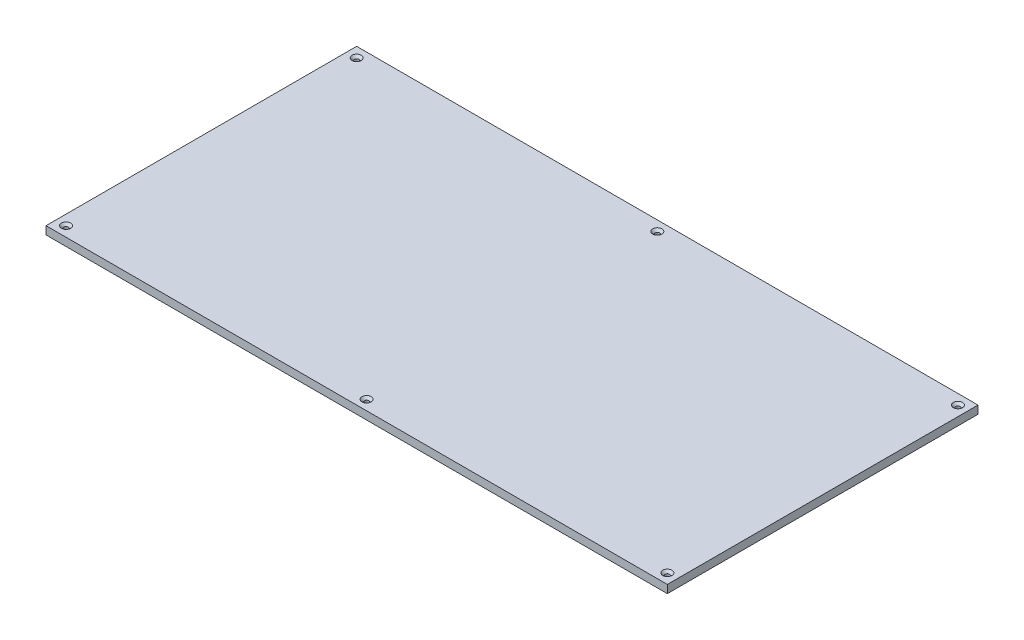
ISO-10303-21;
HEADER;
FILE_DESCRIPTION(('STEP AP214'),'2;1');
FILE_NAME('part.step','',(''),(''),'','','');
FILE_SCHEMA(('AUTOMOTIVE_DESIGN { 1 0 10303 214 1 1 1 1 }'));
ENDSEC;
DATA;
#1=APPLICATION_CONTEXT('core data for automotive mechanical design processes');
#2=APPLICATION_PROTOCOL_DEFINITION('international standard','automotive_design',2000,#1);
#3=PRODUCT_CONTEXT('',#1,'mechanical');
#4=PRODUCT('Part','Part','',(#3));
#5=PRODUCT_RELATED_PRODUCT_CATEGORY('part','',(#4));
#6=PRODUCT_DEFINITION_FORMATION('','',#4);
#7=PRODUCT_DEFINITION_CONTEXT('part definition',#1,'design');
#8=PRODUCT_DEFINITION('design','',#6,#7);
#9=PRODUCT_DEFINITION_SHAPE('','',#8);
#10=(LENGTH_UNIT() NAMED_UNIT(*) SI_UNIT(.MILLI.,.METRE.));
#11=(NAMED_UNIT(*) PLANE_ANGLE_UNIT() SI_UNIT($,.RADIAN.));
#12=(NAMED_UNIT(*) SI_UNIT($,.STERADIAN.) SOLID_ANGLE_UNIT());
#13=UNCERTAINTY_MEASURE_WITH_UNIT(LENGTH_MEASURE(1.E-05),#10,'distance_accuracy_value','');
#14=(GEOMETRIC_REPRESENTATION_CONTEXT(3) GLOBAL_UNCERTAINTY_ASSIGNED_CONTEXT((#13)) GLOBAL_UNIT_ASSIGNED_CONTEXT((#10,
#11,#12)) REPRESENTATION_CONTEXT('',''));
#15=CARTESIAN_POINT('',(0.,0.,0.));
#16=DIRECTION('',(0.,0.,1.));
#17=DIRECTION('',(1.,0.,0.));
#18=AXIS2_PLACEMENT_3D('',#15,#16,#17);
#19=CARTESIAN_POINT('',(310.,8.,155.));
#20=DIRECTION('',(-1.,0.,0.));
#21=DIRECTION('',(0.,0.,1.));
#22=AXIS2_PLACEMENT_3D('',#19,#20,#21);
#23=PLANE('',#22);
#24=DIRECTION('',(0.,0.,-1.));
#25=VECTOR('',#24,1.);
#26=CARTESIAN_POINT('',(310.,0.,155.));
#27=LINE('',#26,#25);
#28=CARTESIAN_POINT('',(310.,0.,155.));
#29=VERTEX_POINT('',#28);
#30=CARTESIAN_POINT('',(310.,0.,-155.));
#31=VERTEX_POINT('',#30);
#32=EDGE_CURVE('E113',#29,#31,#27,.T.);
#33=ORIENTED_EDGE('',*,*,#32,.T.);
#34=DIRECTION('',(0.,-1.,0.));
#35=VECTOR('',#34,1.);
#36=CARTESIAN_POINT('',(310.,8.,-155.));
#37=LINE('',#36,#35);
#38=CARTESIAN_POINT('',(310.,8.,-155.));
#39=VERTEX_POINT('',#38);
#40=EDGE_CURVE('E11',#39,#31,#37,.T.);
#41=ORIENTED_EDGE('',*,*,#40,.F.);
#42=DIRECTION('',(0.,0.,-1.));
#43=VECTOR('',#42,1.);
#44=CARTESIAN_POINT('',(310.,8.,155.));
#45=LINE('',#44,#43);
#46=CARTESIAN_POINT('',(310.,8.,155.));
#47=VERTEX_POINT('',#46);
#48=EDGE_CURVE('E95',#47,#39,#45,.T.);
#49=ORIENTED_EDGE('',*,*,#48,.F.);
#50=DIRECTION('',(0.,-1.,0.));
#51=VECTOR('',#50,1.);
#52=CARTESIAN_POINT('',(310.,8.,155.));
#53=LINE('',#52,#51);
#54=EDGE_CURVE('E109',#47,#29,#53,.T.);
#55=ORIENTED_EDGE('',*,*,#54,.T.);
#56=EDGE_LOOP('',(#33,#41,#49,#55));
#57=FACE_BOUND('',#56,.T.);
#58=ADVANCED_FACE('F43',(#57),#23,.F.);
#59=CARTESIAN_POINT('',(-310.,8.,-155.));
#60=DIRECTION('',(0.,0.,1.));
#61=DIRECTION('',(1.,0.,0.));
#62=AXIS2_PLACEMENT_3D('',#59,#60,#61);
#63=PLANE('',#62);
#64=DIRECTION('',(-1.,0.,0.));
#65=VECTOR('',#64,1.);
#66=CARTESIAN_POINT('',(-310.,0.,-155.));
#67=LINE('',#66,#65);
#68=CARTESIAN_POINT('',(-310.,0.,-155.));
#69=VERTEX_POINT('',#68);
#70=EDGE_CURVE('E100',#31,#69,#67,.T.);
#71=ORIENTED_EDGE('',*,*,#70,.T.);
#72=DIRECTION('',(0.,-1.,0.));
#73=VECTOR('',#72,1.);
#74=CARTESIAN_POINT('',(-310.,8.,-155.));
#75=LINE('',#74,#73);
#76=CARTESIAN_POINT('',(-310.,8.,-155.));
#77=VERTEX_POINT('',#76);
#78=EDGE_CURVE('E52',#77,#69,#75,.T.);
#79=ORIENTED_EDGE('',*,*,#78,.F.);
#80=DIRECTION('',(-1.,0.,0.));
#81=VECTOR('',#80,1.);
#82=CARTESIAN_POINT('',(-310.,8.,-155.));
#83=LINE('',#82,#81);
#84=EDGE_CURVE('E90',#39,#77,#83,.T.);
#85=ORIENTED_EDGE('',*,*,#84,.F.);
#86=ORIENTED_EDGE('',*,*,#40,.T.);
#87=EDGE_LOOP('',(#71,#79,#85,#86));
#88=FACE_BOUND('',#87,.T.);
#89=ADVANCED_FACE('F99',(#88),#63,.F.);
#90=CARTESIAN_POINT('',(-310.,8.,155.));
#91=DIRECTION('',(1.,0.,0.));
#92=DIRECTION('',(0.,0.,-1.));
#93=AXIS2_PLACEMENT_3D('',#90,#91,#92);
#94=PLANE('',#93);
#95=DIRECTION('',(0.,0.,1.));
#96=VECTOR('',#95,1.);
#97=CARTESIAN_POINT('',(-310.,0.,155.));
#98=LINE('',#97,#96);
#99=CARTESIAN_POINT('',(-310.,0.,155.));
#100=VERTEX_POINT('',#99);
#101=EDGE_CURVE('E77',#69,#100,#98,.T.);
#102=ORIENTED_EDGE('',*,*,#101,.T.);
#103=DIRECTION('',(0.,-1.,0.));
#104=VECTOR('',#103,1.);
#105=CARTESIAN_POINT('',(-310.,8.,155.));
#106=LINE('',#105,#104);
#107=CARTESIAN_POINT('',(-310.,8.,155.));
#108=VERTEX_POINT('',#107);
#109=EDGE_CURVE('E102',#108,#100,#106,.T.);
#110=ORIENTED_EDGE('',*,*,#109,.F.);
#111=DIRECTION('',(0.,0.,1.));
#112=VECTOR('',#111,1.);
#113=CARTESIAN_POINT('',(-310.,8.,155.));
#114=LINE('',#113,#112);
#115=EDGE_CURVE('E93',#77,#108,#114,.T.);
#116=ORIENTED_EDGE('',*,*,#115,.F.);
#117=ORIENTED_EDGE('',*,*,#78,.T.);
#118=EDGE_LOOP('',(#102,#110,#116,#117));
#119=FACE_BOUND('',#118,.T.);
#120=ADVANCED_FACE('F103',(#119),#94,.F.);
#121=CARTESIAN_POINT('',(-310.,8.,155.));
#122=DIRECTION('',(0.,0.,-1.));
#123=DIRECTION('',(-1.,0.,0.));
#124=AXIS2_PLACEMENT_3D('',#121,#122,#123);
#125=PLANE('',#124);
#126=DIRECTION('',(1.,0.,0.));
#127=VECTOR('',#126,1.);
#128=CARTESIAN_POINT('',(-310.,0.,155.));
#129=LINE('',#128,#127);
#130=EDGE_CURVE('E83',#100,#29,#129,.T.);
#131=ORIENTED_EDGE('',*,*,#130,.T.);
#132=ORIENTED_EDGE('',*,*,#54,.F.);
#133=DIRECTION('',(1.,0.,0.));
#134=VECTOR('',#133,1.);
#135=CARTESIAN_POINT('',(-310.,8.,155.));
#136=LINE('',#135,#134);
#137=EDGE_CURVE('E60',#108,#47,#136,.T.);
#138=ORIENTED_EDGE('',*,*,#137,.F.);
#139=ORIENTED_EDGE('',*,*,#109,.T.);
#140=EDGE_LOOP('',(#131,#132,#138,#139));
#141=FACE_BOUND('',#140,.T.);
#142=ADVANCED_FACE('F128',(#141),#125,.F.);
#143=CARTESIAN_POINT('',(0.,8.,0.));
#144=DIRECTION('',(0.,-1.,0.));
#145=DIRECTION('',(0.,0.,-1.));
#146=AXIS2_PLACEMENT_3D('',#143,#144,#145);
#147=PLANE('',#146);
#148=CARTESIAN_POINT('',(-300.,8.,145.));
#149=DIRECTION('',(0.,1.,0.));
#150=DIRECTION('',(0.,0.,1.));
#151=AXIS2_PLACEMENT_3D('',#148,#149,#150);
#152=CIRCLE('',#151,4.59999999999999);
#153=CARTESIAN_POINT('',(-300.,8.,149.6));
#154=VERTEX_POINT('',#153);
#155=EDGE_CURVE('E203',#154,#154,#152,.T.);
#156=ORIENTED_EDGE('',*,*,#155,.F.);
#157=EDGE_LOOP('',(#156));
#158=FACE_BOUND('',#157,.T.);
#159=CARTESIAN_POINT('',(0.,8.,145.));
#160=DIRECTION('',(0.,1.,0.));
#161=DIRECTION('',(0.,0.,1.));
#162=AXIS2_PLACEMENT_3D('',#159,#160,#161);
#163=CIRCLE('',#162,4.6);
#164=CARTESIAN_POINT('',(0.,8.,149.6));
#165=VERTEX_POINT('',#164);
#166=EDGE_CURVE('E191',#165,#165,#163,.T.);
#167=ORIENTED_EDGE('',*,*,#166,.F.);
#168=EDGE_LOOP('',(#167));
#169=FACE_BOUND('',#168,.T.);
#170=CARTESIAN_POINT('',(300.,8.,145.));
#171=DIRECTION('',(0.,1.,0.));
#172=DIRECTION('',(0.,0.,1.));
#173=AXIS2_PLACEMENT_3D('',#170,#171,#172);
#174=CIRCLE('',#173,4.59999999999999);
#175=CARTESIAN_POINT('',(300.,8.,149.6));
#176=VERTEX_POINT('',#175);
#177=EDGE_CURVE('E179',#176,#176,#174,.T.);
#178=ORIENTED_EDGE('',*,*,#177,.F.);
#179=EDGE_LOOP('',(#178));
#180=FACE_BOUND('',#179,.T.);
#181=CARTESIAN_POINT('',(300.,8.,-145.));
#182=DIRECTION('',(0.,1.,0.));
#183=DIRECTION('',(0.,0.,1.));
#184=AXIS2_PLACEMENT_3D('',#181,#182,#183);
#185=CIRCLE('',#184,4.59999999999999);
#186=CARTESIAN_POINT('',(300.,8.,-140.4));
#187=VERTEX_POINT('',#186);
#188=EDGE_CURVE('E167',#187,#187,#185,.T.);
#189=ORIENTED_EDGE('',*,*,#188,.F.);
#190=EDGE_LOOP('',(#189));
#191=FACE_BOUND('',#190,.T.);
#192=CARTESIAN_POINT('',(0.,8.,-145.));
#193=DIRECTION('',(0.,1.,0.));
#194=DIRECTION('',(0.,0.,1.));
#195=AXIS2_PLACEMENT_3D('',#192,#193,#194);
#196=CIRCLE('',#195,4.6);
#197=CARTESIAN_POINT('',(0.,8.,-140.4));
#198=VERTEX_POINT('',#197);
#199=EDGE_CURVE('E155',#198,#198,#196,.T.);
#200=ORIENTED_EDGE('',*,*,#199,.F.);
#201=EDGE_LOOP('',(#200));
#202=FACE_BOUND('',#201,.T.);
#203=CARTESIAN_POINT('',(-300.,8.,-145.));
#204=DIRECTION('',(0.,1.,0.));
#205=DIRECTION('',(0.,0.,1.));
#206=AXIS2_PLACEMENT_3D('',#203,#204,#205);
#207=CIRCLE('',#206,4.59999999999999);
#208=CARTESIAN_POINT('',(-300.,8.,-140.4));
#209=VERTEX_POINT('',#208);
#210=EDGE_CURVE('E143',#209,#209,#207,.T.);
#211=ORIENTED_EDGE('',*,*,#210,.F.);
#212=EDGE_LOOP('',(#211));
#213=FACE_BOUND('',#212,.T.);
#214=ORIENTED_EDGE('',*,*,#48,.T.);
#215=ORIENTED_EDGE('',*,*,#84,.T.);
#216=ORIENTED_EDGE('',*,*,#115,.T.);
#217=ORIENTED_EDGE('',*,*,#137,.T.);
#218=EDGE_LOOP('',(#214,#215,#216,#217));
#219=FACE_BOUND('',#218,.T.);
#220=ADVANCED_FACE('F91',(#158,#169,#180,#191,#202,#213,#219),#147,.F.);
#221=CARTESIAN_POINT('',(0.,0.,0.));
#222=DIRECTION('',(0.,-1.,0.));
#223=DIRECTION('',(0.,0.,-1.));
#224=AXIS2_PLACEMENT_3D('',#221,#222,#223);
#225=PLANE('',#224);
#226=CARTESIAN_POINT('',(-300.,0.,145.));
#227=DIRECTION('',(0.,1.,0.));
#228=DIRECTION('',(0.,0.,1.));
#229=AXIS2_PLACEMENT_3D('',#226,#227,#228);
#230=CIRCLE('',#229,2.24999999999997);
#231=CARTESIAN_POINT('',(-300.,0.,147.25));
#232=VERTEX_POINT('',#231);
#233=EDGE_CURVE('E195',#232,#232,#230,.T.);
#234=ORIENTED_EDGE('',*,*,#233,.T.);
#235=EDGE_LOOP('',(#234));
#236=FACE_BOUND('',#235,.T.);
#237=CARTESIAN_POINT('',(0.,0.,145.));
#238=DIRECTION('',(0.,1.,0.));
#239=DIRECTION('',(0.,0.,1.));
#240=AXIS2_PLACEMENT_3D('',#237,#238,#239);
#241=CIRCLE('',#240,2.25);
#242=CARTESIAN_POINT('',(0.,0.,147.25));
#243=VERTEX_POINT('',#242);
#244=EDGE_CURVE('E183',#243,#243,#241,.T.);
#245=ORIENTED_EDGE('',*,*,#244,.T.);
#246=EDGE_LOOP('',(#245));
#247=FACE_BOUND('',#246,.T.);
#248=CARTESIAN_POINT('',(300.,0.,145.));
#249=DIRECTION('',(0.,1.,0.));
#250=DIRECTION('',(0.,0.,1.));
#251=AXIS2_PLACEMENT_3D('',#248,#249,#250);
#252=CIRCLE('',#251,2.24999999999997);
#253=CARTESIAN_POINT('',(300.,0.,147.25));
#254=VERTEX_POINT('',#253);
#255=EDGE_CURVE('E171',#254,#254,#252,.T.);
#256=ORIENTED_EDGE('',*,*,#255,.T.);
#257=EDGE_LOOP('',(#256));
#258=FACE_BOUND('',#257,.T.);
#259=CARTESIAN_POINT('',(300.,0.,-145.));
#260=DIRECTION('',(0.,1.,0.));
#261=DIRECTION('',(0.,0.,1.));
#262=AXIS2_PLACEMENT_3D('',#259,#260,#261);
#263=CIRCLE('',#262,2.24999999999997);
#264=CARTESIAN_POINT('',(300.,0.,-142.75));
#265=VERTEX_POINT('',#264);
#266=EDGE_CURVE('E159',#265,#265,#263,.T.);
#267=ORIENTED_EDGE('',*,*,#266,.T.);
#268=EDGE_LOOP('',(#267));
#269=FACE_BOUND('',#268,.T.);
#270=CARTESIAN_POINT('',(0.,0.,-145.));
#271=DIRECTION('',(0.,1.,0.));
#272=DIRECTION('',(0.,0.,1.));
#273=AXIS2_PLACEMENT_3D('',#270,#271,#272);
#274=CIRCLE('',#273,2.25);
#275=CARTESIAN_POINT('',(0.,0.,-142.75));
#276=VERTEX_POINT('',#275);
#277=EDGE_CURVE('E147',#276,#276,#274,.T.);
#278=ORIENTED_EDGE('',*,*,#277,.T.);
#279=EDGE_LOOP('',(#278));
#280=FACE_BOUND('',#279,.T.);
#281=CARTESIAN_POINT('',(-300.,0.,-145.));
#282=DIRECTION('',(0.,1.,0.));
#283=DIRECTION('',(0.,0.,1.));
#284=AXIS2_PLACEMENT_3D('',#281,#282,#283);
#285=CIRCLE('',#284,2.24999999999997);
#286=CARTESIAN_POINT('',(-300.,0.,-142.75));
#287=VERTEX_POINT('',#286);
#288=EDGE_CURVE('E117',#287,#287,#285,.T.);
#289=ORIENTED_EDGE('',*,*,#288,.T.);
#290=EDGE_LOOP('',(#289));
#291=FACE_BOUND('',#290,.T.);
#292=ORIENTED_EDGE('',*,*,#32,.F.);
#293=ORIENTED_EDGE('',*,*,#130,.F.);
#294=ORIENTED_EDGE('',*,*,#101,.F.);
#295=ORIENTED_EDGE('',*,*,#70,.F.);
#296=EDGE_LOOP('',(#292,#293,#294,#295));
#297=FACE_BOUND('',#296,.T.);
#298=ADVANCED_FACE('F131',(#236,#247,#258,#269,#280,#291,#297),#225,.T.);
#299=CARTESIAN_POINT('',(-300.,8.,-145.));
#300=DIRECTION('',(0.,1.,0.));
#301=DIRECTION('',(0.,0.,1.));
#302=AXIS2_PLACEMENT_3D('',#299,#300,#301);
#303=CYLINDRICAL_SURFACE('',#302,2.24999999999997);
#304=ORIENTED_EDGE('',*,*,#288,.F.);
#305=EDGE_LOOP('',(#304));
#306=FACE_BOUND('',#305,.T.);
#307=CARTESIAN_POINT('',(-300.,5.65,-145.));
#308=DIRECTION('',(0.,1.,0.));
#309=DIRECTION('',(0.,0.,1.));
#310=AXIS2_PLACEMENT_3D('',#307,#308,#309);
#311=CIRCLE('',#310,2.24999999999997);
#312=CARTESIAN_POINT('',(-300.,5.65,-142.75));
#313=VERTEX_POINT('',#312);
#314=EDGE_CURVE('E139',#313,#313,#311,.T.);
#315=ORIENTED_EDGE('',*,*,#314,.T.);
#316=EDGE_LOOP('',(#315));
#317=FACE_BOUND('',#316,.T.);
#318=ADVANCED_FACE('F227',(#306,#317),#303,.F.);
#319=CARTESIAN_POINT('',(-300.,8.,-145.));
#320=DIRECTION('',(0.,1.,0.));
#321=DIRECTION('',(0.,0.,1.));
#322=AXIS2_PLACEMENT_3D('',#319,#320,#321);
#323=CONICAL_SURFACE('',#322,4.59999999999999,0.785398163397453);
#324=ORIENTED_EDGE('',*,*,#314,.F.);
#325=EDGE_LOOP('',(#324));
#326=FACE_BOUND('',#325,.T.);
#327=ORIENTED_EDGE('',*,*,#210,.T.);
#328=EDGE_LOOP('',(#327));
#329=FACE_BOUND('',#328,.T.);
#330=ADVANCED_FACE('F224',(#326,#329),#323,.F.);
#331=CARTESIAN_POINT('',(0.,8.,-145.));
#332=DIRECTION('',(0.,1.,0.));
#333=DIRECTION('',(0.,0.,1.));
#334=AXIS2_PLACEMENT_3D('',#331,#332,#333);
#335=CYLINDRICAL_SURFACE('',#334,2.25);
#336=ORIENTED_EDGE('',*,*,#277,.F.);
#337=EDGE_LOOP('',(#336));
#338=FACE_BOUND('',#337,.T.);
#339=CARTESIAN_POINT('',(0.,5.65,-145.));
#340=DIRECTION('',(0.,1.,0.));
#341=DIRECTION('',(0.,0.,1.));
#342=AXIS2_PLACEMENT_3D('',#339,#340,#341);
#343=CIRCLE('',#342,2.25);
#344=CARTESIAN_POINT('',(0.,5.65,-142.75));
#345=VERTEX_POINT('',#344);
#346=EDGE_CURVE('E151',#345,#345,#343,.T.);
#347=ORIENTED_EDGE('',*,*,#346,.T.);
#348=EDGE_LOOP('',(#347));
#349=FACE_BOUND('',#348,.T.);
#350=ADVANCED_FACE('F226',(#338,#349),#335,.F.);
#351=CARTESIAN_POINT('',(0.,8.,-145.));
#352=DIRECTION('',(0.,1.,0.));
#353=DIRECTION('',(0.,0.,1.));
#354=AXIS2_PLACEMENT_3D('',#351,#352,#353);
#355=CONICAL_SURFACE('',#354,4.6,0.785398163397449);
#356=ORIENTED_EDGE('',*,*,#346,.F.);
#357=EDGE_LOOP('',(#356));
#358=FACE_BOUND('',#357,.T.);
#359=ORIENTED_EDGE('',*,*,#199,.T.);
#360=EDGE_LOOP('',(#359));
#361=FACE_BOUND('',#360,.T.);
#362=ADVANCED_FACE('F234',(#358,#361),#355,.F.);
#363=CARTESIAN_POINT('',(300.,8.,-145.));
#364=DIRECTION('',(0.,1.,0.));
#365=DIRECTION('',(0.,0.,1.));
#366=AXIS2_PLACEMENT_3D('',#363,#364,#365);
#367=CYLINDRICAL_SURFACE('',#366,2.24999999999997);
#368=ORIENTED_EDGE('',*,*,#266,.F.);
#369=EDGE_LOOP('',(#368));
#370=FACE_BOUND('',#369,.T.);
#371=CARTESIAN_POINT('',(300.,5.65,-145.));
#372=DIRECTION('',(0.,1.,0.));
#373=DIRECTION('',(0.,0.,1.));
#374=AXIS2_PLACEMENT_3D('',#371,#372,#373);
#375=CIRCLE('',#374,2.24999999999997);
#376=CARTESIAN_POINT('',(300.,5.65,-142.75));
#377=VERTEX_POINT('',#376);
#378=EDGE_CURVE('E163',#377,#377,#375,.T.);
#379=ORIENTED_EDGE('',*,*,#378,.T.);
#380=EDGE_LOOP('',(#379));
#381=FACE_BOUND('',#380,.T.);
#382=ADVANCED_FACE('F272',(#370,#381),#367,.F.);
#383=CARTESIAN_POINT('',(300.,8.,-145.));
#384=DIRECTION('',(0.,1.,0.));
#385=DIRECTION('',(0.,0.,1.));
#386=AXIS2_PLACEMENT_3D('',#383,#384,#385);
#387=CONICAL_SURFACE('',#386,4.59999999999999,0.785398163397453);
#388=ORIENTED_EDGE('',*,*,#378,.F.);
#389=EDGE_LOOP('',(#388));
#390=FACE_BOUND('',#389,.T.);
#391=ORIENTED_EDGE('',*,*,#188,.T.);
#392=EDGE_LOOP('',(#391));
#393=FACE_BOUND('',#392,.T.);
#394=ADVANCED_FACE('F277',(#390,#393),#387,.F.);
#395=CARTESIAN_POINT('',(300.,8.,145.));
#396=DIRECTION('',(0.,1.,0.));
#397=DIRECTION('',(0.,0.,1.));
#398=AXIS2_PLACEMENT_3D('',#395,#396,#397);
#399=CYLINDRICAL_SURFACE('',#398,2.24999999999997);
#400=ORIENTED_EDGE('',*,*,#255,.F.);
#401=EDGE_LOOP('',(#400));
#402=FACE_BOUND('',#401,.T.);
#403=CARTESIAN_POINT('',(300.,5.65,145.));
#404=DIRECTION('',(0.,1.,0.));
#405=DIRECTION('',(0.,0.,1.));
#406=AXIS2_PLACEMENT_3D('',#403,#404,#405);
#407=CIRCLE('',#406,2.24999999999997);
#408=CARTESIAN_POINT('',(300.,5.65,147.25));
#409=VERTEX_POINT('',#408);
#410=EDGE_CURVE('E175',#409,#409,#407,.T.);
#411=ORIENTED_EDGE('',*,*,#410,.T.);
#412=EDGE_LOOP('',(#411));
#413=FACE_BOUND('',#412,.T.);
#414=ADVANCED_FACE('F283',(#402,#413),#399,.F.);
#415=CARTESIAN_POINT('',(300.,8.,145.));
#416=DIRECTION('',(0.,1.,0.));
#417=DIRECTION('',(0.,0.,1.));
#418=AXIS2_PLACEMENT_3D('',#415,#416,#417);
#419=CONICAL_SURFACE('',#418,4.59999999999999,0.785398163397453);
#420=ORIENTED_EDGE('',*,*,#410,.F.);
#421=EDGE_LOOP('',(#420));
#422=FACE_BOUND('',#421,.T.);
#423=ORIENTED_EDGE('',*,*,#177,.T.);
#424=EDGE_LOOP('',(#423));
#425=FACE_BOUND('',#424,.T.);
#426=ADVANCED_FACE('F287',(#422,#425),#419,.F.);
#427=CARTESIAN_POINT('',(0.,8.,145.));
#428=DIRECTION('',(0.,1.,0.));
#429=DIRECTION('',(0.,0.,1.));
#430=AXIS2_PLACEMENT_3D('',#427,#428,#429);
#431=CYLINDRICAL_SURFACE('',#430,2.25);
#432=ORIENTED_EDGE('',*,*,#244,.F.);
#433=EDGE_LOOP('',(#432));
#434=FACE_BOUND('',#433,.T.);
#435=CARTESIAN_POINT('',(0.,5.65,145.));
#436=DIRECTION('',(0.,1.,0.));
#437=DIRECTION('',(0.,0.,1.));
#438=AXIS2_PLACEMENT_3D('',#435,#436,#437);
#439=CIRCLE('',#438,2.25);
#440=CARTESIAN_POINT('',(0.,5.65,147.25));
#441=VERTEX_POINT('',#440);
#442=EDGE_CURVE('E187',#441,#441,#439,.T.);
#443=ORIENTED_EDGE('',*,*,#442,.T.);
#444=EDGE_LOOP('',(#443));
#445=FACE_BOUND('',#444,.T.);
#446=ADVANCED_FACE('F291',(#434,#445),#431,.F.);
#447=CARTESIAN_POINT('',(0.,8.,145.));
#448=DIRECTION('',(0.,1.,0.));
#449=DIRECTION('',(0.,0.,1.));
#450=AXIS2_PLACEMENT_3D('',#447,#448,#449);
#451=CONICAL_SURFACE('',#450,4.6,0.785398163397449);
#452=ORIENTED_EDGE('',*,*,#442,.F.);
#453=EDGE_LOOP('',(#452));
#454=FACE_BOUND('',#453,.T.);
#455=ORIENTED_EDGE('',*,*,#166,.T.);
#456=EDGE_LOOP('',(#455));
#457=FACE_BOUND('',#456,.T.);
#458=ADVANCED_FACE('F295',(#454,#457),#451,.F.);
#459=CARTESIAN_POINT('',(-300.,8.,145.));
#460=DIRECTION('',(0.,1.,0.));
#461=DIRECTION('',(0.,0.,1.));
#462=AXIS2_PLACEMENT_3D('',#459,#460,#461);
#463=CYLINDRICAL_SURFACE('',#462,2.24999999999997);
#464=ORIENTED_EDGE('',*,*,#233,.F.);
#465=EDGE_LOOP('',(#464));
#466=FACE_BOUND('',#465,.T.);
#467=CARTESIAN_POINT('',(-300.,5.65,145.));
#468=DIRECTION('',(0.,1.,0.));
#469=DIRECTION('',(0.,0.,1.));
#470=AXIS2_PLACEMENT_3D('',#467,#468,#469);
#471=CIRCLE('',#470,2.24999999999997);
#472=CARTESIAN_POINT('',(-300.,5.65,147.25));
#473=VERTEX_POINT('',#472);
#474=EDGE_CURVE('E199',#473,#473,#471,.T.);
#475=ORIENTED_EDGE('',*,*,#474,.T.);
#476=EDGE_LOOP('',(#475));
#477=FACE_BOUND('',#476,.T.);
#478=ADVANCED_FACE('F299',(#466,#477),#463,.F.);
#479=CARTESIAN_POINT('',(-300.,8.,145.));
#480=DIRECTION('',(0.,1.,0.));
#481=DIRECTION('',(0.,0.,1.));
#482=AXIS2_PLACEMENT_3D('',#479,#480,#481);
#483=CONICAL_SURFACE('',#482,4.59999999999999,0.785398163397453);
#484=ORIENTED_EDGE('',*,*,#474,.F.);
#485=EDGE_LOOP('',(#484));
#486=FACE_BOUND('',#485,.T.);
#487=ORIENTED_EDGE('',*,*,#155,.T.);
#488=EDGE_LOOP('',(#487));
#489=FACE_BOUND('',#488,.T.);
#490=ADVANCED_FACE('F209',(#486,#489),#483,.F.);
#491=CLOSED_SHELL('',(#58,#89,#120,#142,#220,#298,#318,#330,#350,#362,#382,#394,#414,#426,#446,
#458,#478,#490));
#492=MANIFOLD_SOLID_BREP('B2',#491);
#493=ADVANCED_BREP_SHAPE_REPRESENTATION('',(#18,#492),#14);
#494=SHAPE_DEFINITION_REPRESENTATION(#9,#493);
ENDSEC;
END-ISO-10303-21;
